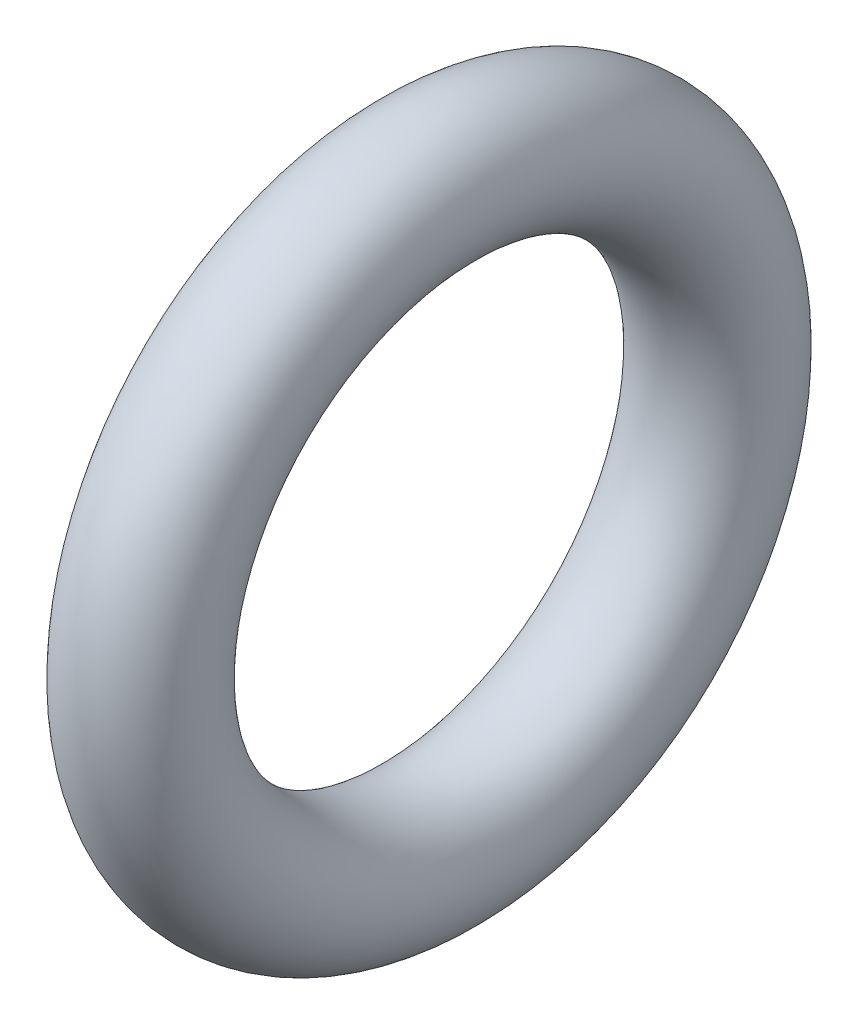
ISO-10303-21;
HEADER;
FILE_DESCRIPTION(('STEP AP214'),'2;1');
FILE_NAME('part.step','',(''),(''),'','','');
FILE_SCHEMA(('AUTOMOTIVE_DESIGN { 1 0 10303 214 1 1 1 1 }'));
ENDSEC;
DATA;
#1=APPLICATION_CONTEXT('core data for automotive mechanical design processes');
#2=APPLICATION_PROTOCOL_DEFINITION('international standard','automotive_design',2000,#1);
#3=PRODUCT_CONTEXT('',#1,'mechanical');
#4=PRODUCT('Part','Part','',(#3));
#5=PRODUCT_RELATED_PRODUCT_CATEGORY('part','',(#4));
#6=PRODUCT_DEFINITION_FORMATION('','',#4);
#7=PRODUCT_DEFINITION_CONTEXT('part definition',#1,'design');
#8=PRODUCT_DEFINITION('design','',#6,#7);
#9=PRODUCT_DEFINITION_SHAPE('','',#8);
#10=(LENGTH_UNIT() NAMED_UNIT(*) SI_UNIT(.MILLI.,.METRE.));
#11=(NAMED_UNIT(*) PLANE_ANGLE_UNIT() SI_UNIT($,.RADIAN.));
#12=(NAMED_UNIT(*) SI_UNIT($,.STERADIAN.) SOLID_ANGLE_UNIT());
#13=UNCERTAINTY_MEASURE_WITH_UNIT(LENGTH_MEASURE(1.E-05),#10,'distance_accuracy_value','');
#14=(GEOMETRIC_REPRESENTATION_CONTEXT(3) GLOBAL_UNCERTAINTY_ASSIGNED_CONTEXT((#13)) GLOBAL_UNIT_ASSIGNED_CONTEXT((#10,
#11,#12)) REPRESENTATION_CONTEXT('',''));
#15=CARTESIAN_POINT('',(0.,0.,0.));
#16=DIRECTION('',(0.,0.,1.));
#17=DIRECTION('',(1.,0.,0.));
#18=AXIS2_PLACEMENT_3D('',#15,#16,#17);
#19=CARTESIAN_POINT('',(4.,0.,0.));
#20=DIRECTION('',(1.,0.,0.));
#21=DIRECTION('',(0.,0.877582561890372,0.479425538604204));
#22=AXIS2_PLACEMENT_3D('',#19,#20,#21);
#23=TOROIDAL_SURFACE('',#22,13.05,3.);
#24=ADVANCED_FACE('F12',(),#23,.T.);
#25=CLOSED_SHELL('',(#24));
#26=MANIFOLD_SOLID_BREP('B1',#25);
#27=ADVANCED_BREP_SHAPE_REPRESENTATION('',(#18,#26),#14);
#28=SHAPE_DEFINITION_REPRESENTATION(#9,#27);
ENDSEC;
END-ISO-10303-21;
